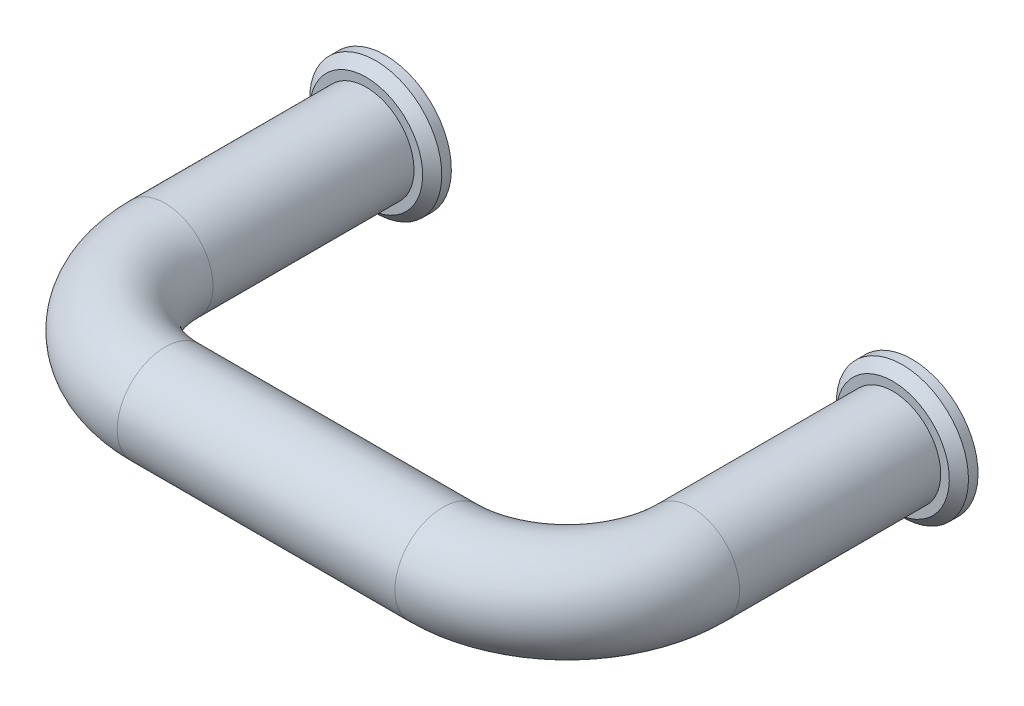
ISO-10303-21;
HEADER;
FILE_DESCRIPTION(('STEP AP214'),'2;1');
FILE_NAME('part.step','',(''),(''),'','','');
FILE_SCHEMA(('AUTOMOTIVE_DESIGN { 1 0 10303 214 1 1 1 1 }'));
ENDSEC;
DATA;
#1=APPLICATION_CONTEXT('core data for automotive mechanical design processes');
#2=APPLICATION_PROTOCOL_DEFINITION('international standard','automotive_design',2000,#1);
#3=PRODUCT_CONTEXT('',#1,'mechanical');
#4=PRODUCT('Part','Part','',(#3));
#5=PRODUCT_RELATED_PRODUCT_CATEGORY('part','',(#4));
#6=PRODUCT_DEFINITION_FORMATION('','',#4);
#7=PRODUCT_DEFINITION_CONTEXT('part definition',#1,'design');
#8=PRODUCT_DEFINITION('design','',#6,#7);
#9=PRODUCT_DEFINITION_SHAPE('','',#8);
#10=(LENGTH_UNIT() NAMED_UNIT(*) SI_UNIT(.MILLI.,.METRE.));
#11=(NAMED_UNIT(*) PLANE_ANGLE_UNIT() SI_UNIT($,.RADIAN.));
#12=(NAMED_UNIT(*) SI_UNIT($,.STERADIAN.) SOLID_ANGLE_UNIT());
#13=UNCERTAINTY_MEASURE_WITH_UNIT(LENGTH_MEASURE(1.E-05),#10,'distance_accuracy_value','');
#14=(GEOMETRIC_REPRESENTATION_CONTEXT(3) GLOBAL_UNCERTAINTY_ASSIGNED_CONTEXT((#13)) GLOBAL_UNIT_ASSIGNED_CONTEXT((#10,
#11,#12)) REPRESENTATION_CONTEXT('',''));
#15=CARTESIAN_POINT('',(0.,0.,0.));
#16=DIRECTION('',(0.,0.,1.));
#17=DIRECTION('',(1.,0.,0.));
#18=AXIS2_PLACEMENT_3D('',#15,#16,#17);
#19=CARTESIAN_POINT('',(55.,0.,0.));
#20=DIRECTION('',(0.,0.,-1.));
#21=DIRECTION('',(0.,1.,0.));
#22=AXIS2_PLACEMENT_3D('',#19,#20,#21);
#23=PLANE('',#22);
#24=CARTESIAN_POINT('',(55.,0.,0.));
#25=DIRECTION('',(0.,0.,-1.));
#26=DIRECTION('',(0.,1.,0.));
#27=AXIS2_PLACEMENT_3D('',#24,#25,#26);
#28=CIRCLE('',#27,6.9);
#29=CARTESIAN_POINT('',(55.,6.9,0.));
#30=VERTEX_POINT('',#29);
#31=EDGE_CURVE('E50',#30,#30,#28,.T.);
#32=ORIENTED_EDGE('',*,*,#31,.T.);
#33=EDGE_LOOP('',(#32));
#34=FACE_BOUND('',#33,.T.);
#35=CARTESIAN_POINT('',(55.,0.,0.));
#36=DIRECTION('',(0.,0.,1.));
#37=DIRECTION('',(0.,1.,0.));
#38=AXIS2_PLACEMENT_3D('',#35,#36,#37);
#39=CIRCLE('',#38,2.5);
#40=CARTESIAN_POINT('',(55.,2.5,0.));
#41=VERTEX_POINT('',#40);
#42=EDGE_CURVE('E59',#41,#41,#39,.T.);
#43=ORIENTED_EDGE('',*,*,#42,.T.);
#44=EDGE_LOOP('',(#43));
#45=FACE_BOUND('',#44,.T.);
#46=ADVANCED_FACE('F12',(#34,#45),#23,.T.);
#47=CARTESIAN_POINT('',(0.,0.,23.));
#48=DIRECTION('',(0.,0.,-1.));
#49=DIRECTION('',(0.,1.,0.));
#50=AXIS2_PLACEMENT_3D('',#47,#48,#49);
#51=CYLINDRICAL_SURFACE('',#50,5.);
#52=CARTESIAN_POINT('',(0.,0.,23.));
#53=DIRECTION('',(0.,0.,-1.));
#54=DIRECTION('',(0.,-1.,0.));
#55=AXIS2_PLACEMENT_3D('',#52,#53,#54);
#56=CIRCLE('',#55,5.);
#57=CARTESIAN_POINT('',(-5.,0.,23.));
#58=VERTEX_POINT('',#57);
#59=EDGE_CURVE('E35',#58,#58,#56,.T.);
#60=ORIENTED_EDGE('',*,*,#59,.T.);
#61=EDGE_LOOP('',(#60));
#62=FACE_BOUND('',#61,.T.);
#63=CARTESIAN_POINT('',(0.,0.,2.));
#64=DIRECTION('',(0.,0.,-1.));
#65=DIRECTION('',(0.,-1.,0.));
#66=AXIS2_PLACEMENT_3D('',#63,#64,#65);
#67=CIRCLE('',#66,5.);
#68=CARTESIAN_POINT('',(0.,-5.,2.));
#69=VERTEX_POINT('',#68);
#70=EDGE_CURVE('E32',#69,#69,#67,.T.);
#71=ORIENTED_EDGE('',*,*,#70,.F.);
#72=EDGE_LOOP('',(#71));
#73=FACE_BOUND('',#72,.T.);
#74=ADVANCED_FACE('F14',(#62,#73),#51,.T.);
#75=CARTESIAN_POINT('',(13.,0.,23.));
#76=DIRECTION('',(0.,-1.,0.));
#77=DIRECTION('',(1.,0.,0.));
#78=AXIS2_PLACEMENT_3D('',#75,#76,#77);
#79=TOROIDAL_SURFACE('',#78,13.,5.);
#80=CARTESIAN_POINT('',(13.,0.,36.));
#81=DIRECTION('',(-1.,0.,0.));
#82=DIRECTION('',(0.,-1.,0.));
#83=AXIS2_PLACEMENT_3D('',#80,#81,#82);
#84=CIRCLE('',#83,5.);
#85=CARTESIAN_POINT('',(13.,0.,41.));
#86=VERTEX_POINT('',#85);
#87=EDGE_CURVE('E38',#86,#86,#84,.T.);
#88=CARTESIAN_POINT('',(13.,0.,23.));
#89=DIRECTION('',(0.,-1.,0.));
#90=DIRECTION('',(1.,0.,0.));
#91=AXIS2_PLACEMENT_3D('',#88,#89,#90);
#92=CIRCLE('',#91,18.);
#93=EDGE_CURVE('',#86,#58,#92,.T.);
#94=ORIENTED_EDGE('',*,*,#87,.T.);
#95=ORIENTED_EDGE('',*,*,#59,.F.);
#96=ORIENTED_EDGE('',*,*,#93,.T.);
#97=ORIENTED_EDGE('',*,*,#93,.F.);
#98=EDGE_LOOP('',(#94,#96,#95,#97));
#99=FACE_BOUND('',#98,.T.);
#100=ADVANCED_FACE('F96',(#99),#79,.T.);
#101=CARTESIAN_POINT('',(42.,0.,36.));
#102=DIRECTION('',(-1.,0.,0.));
#103=DIRECTION('',(0.,-1.,0.));
#104=AXIS2_PLACEMENT_3D('',#101,#102,#103);
#105=CYLINDRICAL_SURFACE('',#104,5.);
#106=CARTESIAN_POINT('',(42.,0.,36.));
#107=DIRECTION('',(-1.,0.,0.));
#108=DIRECTION('',(0.,-1.,0.));
#109=AXIS2_PLACEMENT_3D('',#106,#107,#108);
#110=CIRCLE('',#109,5.);
#111=CARTESIAN_POINT('',(42.,0.,41.));
#112=VERTEX_POINT('',#111);
#113=EDGE_CURVE('E41',#112,#112,#110,.T.);
#114=ORIENTED_EDGE('',*,*,#113,.T.);
#115=EDGE_LOOP('',(#114));
#116=FACE_BOUND('',#115,.T.);
#117=ORIENTED_EDGE('',*,*,#87,.F.);
#118=EDGE_LOOP('',(#117));
#119=FACE_BOUND('',#118,.T.);
#120=ADVANCED_FACE('F114',(#116,#119),#105,.T.);
#121=CARTESIAN_POINT('',(42.,0.,23.));
#122=DIRECTION('',(0.,-1.,0.));
#123=DIRECTION('',(1.,0.,0.));
#124=AXIS2_PLACEMENT_3D('',#121,#122,#123);
#125=TOROIDAL_SURFACE('',#124,13.,5.);
#126=CARTESIAN_POINT('',(55.,0.,23.));
#127=DIRECTION('',(0.,0.,1.));
#128=DIRECTION('',(0.,-1.,0.));
#129=AXIS2_PLACEMENT_3D('',#126,#127,#128);
#130=CIRCLE('',#129,5.);
#131=CARTESIAN_POINT('',(60.,0.,23.));
#132=VERTEX_POINT('',#131);
#133=EDGE_CURVE('E44',#132,#132,#130,.T.);
#134=CARTESIAN_POINT('',(42.,0.,23.));
#135=DIRECTION('',(0.,-1.,0.));
#136=DIRECTION('',(1.,0.,0.));
#137=AXIS2_PLACEMENT_3D('',#134,#135,#136);
#138=CIRCLE('',#137,18.);
#139=EDGE_CURVE('',#132,#112,#138,.T.);
#140=ORIENTED_EDGE('',*,*,#133,.T.);
#141=ORIENTED_EDGE('',*,*,#113,.F.);
#142=ORIENTED_EDGE('',*,*,#139,.T.);
#143=ORIENTED_EDGE('',*,*,#139,.F.);
#144=EDGE_LOOP('',(#140,#142,#141,#143));
#145=FACE_BOUND('',#144,.T.);
#146=ADVANCED_FACE('F110',(#145),#125,.T.);
#147=CARTESIAN_POINT('',(55.,0.,23.));
#148=DIRECTION('',(0.,0.,-1.));
#149=DIRECTION('',(0.,1.,0.));
#150=AXIS2_PLACEMENT_3D('',#147,#148,#149);
#151=CYLINDRICAL_SURFACE('',#150,5.);
#152=ORIENTED_EDGE('',*,*,#133,.F.);
#153=EDGE_LOOP('',(#152));
#154=FACE_BOUND('',#153,.T.);
#155=CARTESIAN_POINT('',(55.,0.,2.));
#156=DIRECTION('',(0.,0.,1.));
#157=DIRECTION('',(0.,-1.,0.));
#158=AXIS2_PLACEMENT_3D('',#155,#156,#157);
#159=CIRCLE('',#158,5.);
#160=CARTESIAN_POINT('',(55.,-5.,2.));
#161=VERTEX_POINT('',#160);
#162=EDGE_CURVE('E47',#161,#161,#159,.T.);
#163=ORIENTED_EDGE('',*,*,#162,.T.);
#164=EDGE_LOOP('',(#163));
#165=FACE_BOUND('',#164,.T.);
#166=ADVANCED_FACE('F106',(#154,#165),#151,.T.);
#167=CARTESIAN_POINT('',(55.,0.,0.));
#168=DIRECTION('',(0.,0.,1.));
#169=DIRECTION('',(0.,-1.,0.));
#170=AXIS2_PLACEMENT_3D('',#167,#168,#169);
#171=CYLINDRICAL_SURFACE('',#170,6.9);
#172=CARTESIAN_POINT('',(55.,0.,0.999999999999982));
#173=DIRECTION('',(0.,0.,-1.));
#174=DIRECTION('',(0.,1.,0.));
#175=AXIS2_PLACEMENT_3D('',#172,#173,#174);
#176=CIRCLE('',#175,6.9);
#177=CARTESIAN_POINT('',(55.,6.9,0.999999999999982));
#178=VERTEX_POINT('',#177);
#179=EDGE_CURVE('E27',#178,#178,#176,.T.);
#180=ORIENTED_EDGE('',*,*,#179,.T.);
#181=EDGE_LOOP('',(#180));
#182=FACE_BOUND('',#181,.T.);
#183=ORIENTED_EDGE('',*,*,#31,.F.);
#184=EDGE_LOOP('',(#183));
#185=FACE_BOUND('',#184,.T.);
#186=ADVANCED_FACE('F103',(#182,#185),#171,.T.);
#187=CARTESIAN_POINT('',(55.,0.,2.));
#188=DIRECTION('',(0.,0.,-1.));
#189=DIRECTION('',(0.,1.,0.));
#190=AXIS2_PLACEMENT_3D('',#187,#188,#189);
#191=PLANE('',#190);
#192=CARTESIAN_POINT('',(55.,0.,2.));
#193=DIRECTION('',(0.,0.,-1.));
#194=DIRECTION('',(0.,1.,0.));
#195=AXIS2_PLACEMENT_3D('',#192,#193,#194);
#196=CIRCLE('',#195,5.9);
#197=CARTESIAN_POINT('',(55.,5.9,2.));
#198=VERTEX_POINT('',#197);
#199=EDGE_CURVE('E23',#198,#198,#196,.F.);
#200=ORIENTED_EDGE('',*,*,#199,.T.);
#201=EDGE_LOOP('',(#200));
#202=FACE_BOUND('',#201,.T.);
#203=ORIENTED_EDGE('',*,*,#162,.F.);
#204=EDGE_LOOP('',(#203));
#205=FACE_BOUND('',#204,.T.);
#206=ADVANCED_FACE('F101',(#202,#205),#191,.F.);
#207=CARTESIAN_POINT('',(55.,0.,0.999999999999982));
#208=DIRECTION('',(0.,0.,-1.));
#209=DIRECTION('',(0.,1.,0.));
#210=AXIS2_PLACEMENT_3D('',#207,#208,#209);
#211=CONICAL_SURFACE('',#210,6.9,0.785398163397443);
#212=ORIENTED_EDGE('',*,*,#199,.F.);
#213=EDGE_LOOP('',(#212));
#214=FACE_BOUND('',#213,.T.);
#215=ORIENTED_EDGE('',*,*,#179,.F.);
#216=EDGE_LOOP('',(#215));
#217=FACE_BOUND('',#216,.T.);
#218=ADVANCED_FACE('F132',(#214,#217),#211,.T.);
#219=CARTESIAN_POINT('',(0.,0.,2.));
#220=DIRECTION('',(0.,0.,-1.));
#221=DIRECTION('',(0.,1.,0.));
#222=AXIS2_PLACEMENT_3D('',#219,#220,#221);
#223=PLANE('',#222);
#224=CARTESIAN_POINT('',(0.,0.,2.));
#225=DIRECTION('',(0.,0.,-1.));
#226=DIRECTION('',(0.,1.,0.));
#227=AXIS2_PLACEMENT_3D('',#224,#225,#226);
#228=CIRCLE('',#227,5.9);
#229=CARTESIAN_POINT('',(0.,5.9,2.));
#230=VERTEX_POINT('',#229);
#231=EDGE_CURVE('E19',#230,#230,#228,.F.);
#232=ORIENTED_EDGE('',*,*,#231,.T.);
#233=EDGE_LOOP('',(#232));
#234=FACE_BOUND('',#233,.T.);
#235=ORIENTED_EDGE('',*,*,#70,.T.);
#236=EDGE_LOOP('',(#235));
#237=FACE_BOUND('',#236,.T.);
#238=ADVANCED_FACE('F129',(#234,#237),#223,.F.);
#239=CARTESIAN_POINT('',(0.,0.,0.));
#240=DIRECTION('',(0.,0.,1.));
#241=DIRECTION('',(0.,-1.,0.));
#242=AXIS2_PLACEMENT_3D('',#239,#240,#241);
#243=CYLINDRICAL_SURFACE('',#242,6.9);
#244=CARTESIAN_POINT('',(0.,0.,1.));
#245=DIRECTION('',(0.,0.,-1.));
#246=DIRECTION('',(0.,1.,0.));
#247=AXIS2_PLACEMENT_3D('',#244,#245,#246);
#248=CIRCLE('',#247,6.9);
#249=CARTESIAN_POINT('',(0.,6.9,1.));
#250=VERTEX_POINT('',#249);
#251=EDGE_CURVE('E8',#250,#250,#248,.T.);
#252=ORIENTED_EDGE('',*,*,#251,.T.);
#253=EDGE_LOOP('',(#252));
#254=FACE_BOUND('',#253,.T.);
#255=CARTESIAN_POINT('',(0.,0.,0.));
#256=DIRECTION('',(0.,0.,1.));
#257=DIRECTION('',(0.,1.,0.));
#258=AXIS2_PLACEMENT_3D('',#255,#256,#257);
#259=CIRCLE('',#258,6.9);
#260=CARTESIAN_POINT('',(0.,6.9,0.));
#261=VERTEX_POINT('',#260);
#262=EDGE_CURVE('E53',#261,#261,#259,.T.);
#263=ORIENTED_EDGE('',*,*,#262,.T.);
#264=EDGE_LOOP('',(#263));
#265=FACE_BOUND('',#264,.T.);
#266=ADVANCED_FACE('F131',(#254,#265),#243,.T.);
#267=CARTESIAN_POINT('',(0.,0.,0.));
#268=DIRECTION('',(0.,0.,-1.));
#269=DIRECTION('',(0.,1.,0.));
#270=AXIS2_PLACEMENT_3D('',#267,#268,#269);
#271=PLANE('',#270);
#272=CARTESIAN_POINT('',(0.,0.,0.));
#273=DIRECTION('',(0.,0.,-1.));
#274=DIRECTION('',(0.,1.,0.));
#275=AXIS2_PLACEMENT_3D('',#272,#273,#274);
#276=CIRCLE('',#275,2.5);
#277=CARTESIAN_POINT('',(0.,2.5,0.));
#278=VERTEX_POINT('',#277);
#279=EDGE_CURVE('E56',#278,#278,#276,.T.);
#280=ORIENTED_EDGE('',*,*,#279,.F.);
#281=EDGE_LOOP('',(#280));
#282=FACE_BOUND('',#281,.T.);
#283=ORIENTED_EDGE('',*,*,#262,.F.);
#284=EDGE_LOOP('',(#283));
#285=FACE_BOUND('',#284,.T.);
#286=ADVANCED_FACE('F134',(#282,#285),#271,.T.);
#287=CARTESIAN_POINT('',(0.,0.,2.));
#288=DIRECTION('',(0.,0.,-1.));
#289=DIRECTION('',(0.,1.,0.));
#290=AXIS2_PLACEMENT_3D('',#287,#288,#289);
#291=CONICAL_SURFACE('',#290,5.9,0.785398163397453);
#292=ORIENTED_EDGE('',*,*,#251,.F.);
#293=EDGE_LOOP('',(#292));
#294=FACE_BOUND('',#293,.T.);
#295=ORIENTED_EDGE('',*,*,#231,.F.);
#296=EDGE_LOOP('',(#295));
#297=FACE_BOUND('',#296,.T.);
#298=ADVANCED_FACE('F85',(#294,#297),#291,.T.);
#299=CARTESIAN_POINT('',(0.,0.,10.));
#300=DIRECTION('',(0.,0.,-1.));
#301=DIRECTION('',(0.,1.,0.));
#302=AXIS2_PLACEMENT_3D('',#299,#300,#301);
#303=CYLINDRICAL_SURFACE('',#302,2.5);
#304=ORIENTED_EDGE('',*,*,#279,.T.);
#305=EDGE_LOOP('',(#304));
#306=FACE_BOUND('',#305,.T.);
#307=CARTESIAN_POINT('',(0.,0.,11.));
#308=DIRECTION('',(0.,0.,-1.));
#309=DIRECTION('',(-1.,0.,0.));
#310=AXIS2_PLACEMENT_3D('',#307,#308,#309);
#311=CIRCLE('',#310,2.5);
#312=CARTESIAN_POINT('',(-2.5,0.,11.));
#313=VERTEX_POINT('',#312);
#314=EDGE_CURVE('E62',#313,#313,#311,.T.);
#315=ORIENTED_EDGE('',*,*,#314,.F.);
#316=EDGE_LOOP('',(#315));
#317=FACE_BOUND('',#316,.T.);
#318=ADVANCED_FACE('F74',(#306,#317),#303,.F.);
#319=CARTESIAN_POINT('',(55.,0.,10.));
#320=DIRECTION('',(0.,0.,-1.));
#321=DIRECTION('',(0.,1.,0.));
#322=AXIS2_PLACEMENT_3D('',#319,#320,#321);
#323=CYLINDRICAL_SURFACE('',#322,2.5);
#324=ORIENTED_EDGE('',*,*,#42,.F.);
#325=EDGE_LOOP('',(#324));
#326=FACE_BOUND('',#325,.T.);
#327=CARTESIAN_POINT('',(55.,0.,11.));
#328=DIRECTION('',(0.,0.,-1.));
#329=DIRECTION('',(-1.,0.,0.));
#330=AXIS2_PLACEMENT_3D('',#327,#328,#329);
#331=CIRCLE('',#330,2.5);
#332=CARTESIAN_POINT('',(52.5,0.,11.));
#333=VERTEX_POINT('',#332);
#334=EDGE_CURVE('E65',#333,#333,#331,.T.);
#335=ORIENTED_EDGE('',*,*,#334,.F.);
#336=EDGE_LOOP('',(#335));
#337=FACE_BOUND('',#336,.T.);
#338=ADVANCED_FACE('F71',(#326,#337),#323,.F.);
#339=CARTESIAN_POINT('',(0.,0.,11.));
#340=DIRECTION('',(0.,0.,-1.));
#341=DIRECTION('',(-1.,0.,0.));
#342=AXIS2_PLACEMENT_3D('',#339,#340,#341);
#343=PLANE('',#342);
#344=ORIENTED_EDGE('',*,*,#314,.T.);
#345=EDGE_LOOP('',(#344));
#346=FACE_BOUND('',#345,.T.);
#347=ADVANCED_FACE('F73',(#346),#343,.T.);
#348=CARTESIAN_POINT('',(55.,0.,11.));
#349=DIRECTION('',(0.,0.,-1.));
#350=DIRECTION('',(-1.,0.,0.));
#351=AXIS2_PLACEMENT_3D('',#348,#349,#350);
#352=PLANE('',#351);
#353=ORIENTED_EDGE('',*,*,#334,.T.);
#354=EDGE_LOOP('',(#353));
#355=FACE_BOUND('',#354,.T.);
#356=ADVANCED_FACE('F69',(#355),#352,.T.);
#357=CLOSED_SHELL('',(#46,#74,#100,#120,#146,#166,#186,#206,#218,#238,#266,#286,#298,#318,#338,
#347,#356));
#358=MANIFOLD_SOLID_BREP('B1',#357);
#359=ADVANCED_BREP_SHAPE_REPRESENTATION('',(#18,#358),#14);
#360=SHAPE_DEFINITION_REPRESENTATION(#9,#359);
ENDSEC;
END-ISO-10303-21;
